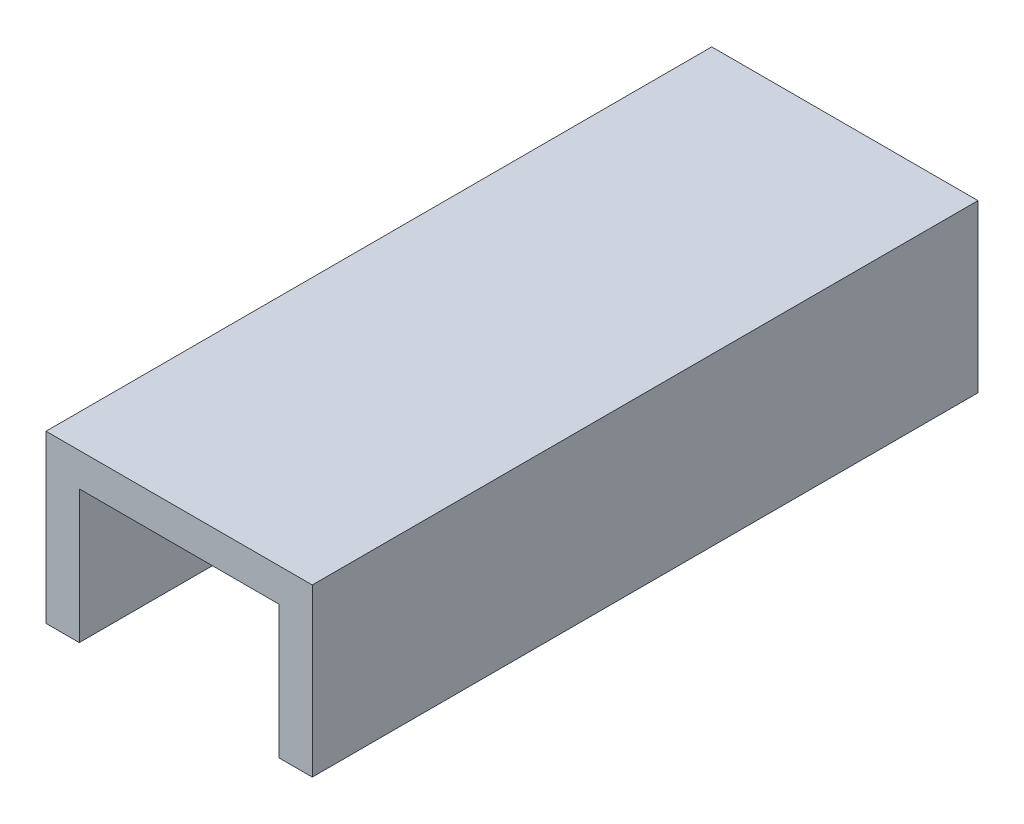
ISO-10303-21;
HEADER;
FILE_DESCRIPTION(('STEP AP214'),'2;1');
FILE_NAME('part.step','',(''),(''),'','','');
FILE_SCHEMA(('AUTOMOTIVE_DESIGN { 1 0 10303 214 1 1 1 1 }'));
ENDSEC;
DATA;
#1=APPLICATION_CONTEXT('core data for automotive mechanical design processes');
#2=APPLICATION_PROTOCOL_DEFINITION('international standard','automotive_design',2000,#1);
#3=PRODUCT_CONTEXT('',#1,'mechanical');
#4=PRODUCT('Part','Part','',(#3));
#5=PRODUCT_RELATED_PRODUCT_CATEGORY('part','',(#4));
#6=PRODUCT_DEFINITION_FORMATION('','',#4);
#7=PRODUCT_DEFINITION_CONTEXT('part definition',#1,'design');
#8=PRODUCT_DEFINITION('design','',#6,#7);
#9=PRODUCT_DEFINITION_SHAPE('','',#8);
#10=(LENGTH_UNIT() NAMED_UNIT(*) SI_UNIT(.MILLI.,.METRE.));
#11=(NAMED_UNIT(*) PLANE_ANGLE_UNIT() SI_UNIT($,.RADIAN.));
#12=(NAMED_UNIT(*) SI_UNIT($,.STERADIAN.) SOLID_ANGLE_UNIT());
#13=UNCERTAINTY_MEASURE_WITH_UNIT(LENGTH_MEASURE(1.E-05),#10,'distance_accuracy_value','');
#14=(GEOMETRIC_REPRESENTATION_CONTEXT(3) GLOBAL_UNCERTAINTY_ASSIGNED_CONTEXT((#13)) GLOBAL_UNIT_ASSIGNED_CONTEXT((#10,
#11,#12)) REPRESENTATION_CONTEXT('',''));
#15=CARTESIAN_POINT('',(0.,0.,0.));
#16=DIRECTION('',(0.,0.,1.));
#17=DIRECTION('',(1.,0.,0.));
#18=AXIS2_PLACEMENT_3D('',#15,#16,#17);
#19=CARTESIAN_POINT('',(-40.,-40.,200.));
#20=DIRECTION('',(1.,0.,0.));
#21=DIRECTION('',(0.,0.,-1.));
#22=AXIS2_PLACEMENT_3D('',#19,#20,#21);
#23=PLANE('',#22);
#24=DIRECTION('',(0.,-1.,0.));
#25=VECTOR('',#24,1.);
#26=CARTESIAN_POINT('',(-40.,-40.,0.));
#27=LINE('',#26,#25);
#28=CARTESIAN_POINT('',(-40.,9.99999999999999,0.));
#29=VERTEX_POINT('',#28);
#30=CARTESIAN_POINT('',(-40.,-40.,0.));
#31=VERTEX_POINT('',#30);
#32=EDGE_CURVE('E101',#29,#31,#27,.T.);
#33=ORIENTED_EDGE('',*,*,#32,.T.);
#34=DIRECTION('',(0.,0.,-1.));
#35=VECTOR('',#34,1.);
#36=CARTESIAN_POINT('',(-40.,-40.,200.));
#37=LINE('',#36,#35);
#38=CARTESIAN_POINT('',(-40.,-40.,200.));
#39=VERTEX_POINT('',#38);
#40=EDGE_CURVE('E11',#39,#31,#37,.T.);
#41=ORIENTED_EDGE('',*,*,#40,.F.);
#42=DIRECTION('',(0.,-1.,0.));
#43=VECTOR('',#42,1.);
#44=CARTESIAN_POINT('',(-40.,-40.,200.));
#45=LINE('',#44,#43);
#46=CARTESIAN_POINT('',(-40.,9.99999999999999,200.));
#47=VERTEX_POINT('',#46);
#48=EDGE_CURVE('E128',#47,#39,#45,.T.);
#49=ORIENTED_EDGE('',*,*,#48,.F.);
#50=DIRECTION('',(0.,0.,-1.));
#51=VECTOR('',#50,1.);
#52=CARTESIAN_POINT('',(-40.,9.99999999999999,200.));
#53=LINE('',#52,#51);
#54=EDGE_CURVE('E114',#47,#29,#53,.T.);
#55=ORIENTED_EDGE('',*,*,#54,.T.);
#56=EDGE_LOOP('',(#33,#41,#49,#55));
#57=FACE_BOUND('',#56,.T.);
#58=ADVANCED_FACE('F33',(#57),#23,.F.);
#59=CARTESIAN_POINT('',(-30.,-40.,200.));
#60=DIRECTION('',(0.,1.,0.));
#61=DIRECTION('',(0.,0.,1.));
#62=AXIS2_PLACEMENT_3D('',#59,#60,#61);
#63=PLANE('',#62);
#64=DIRECTION('',(1.,0.,0.));
#65=VECTOR('',#64,1.);
#66=CARTESIAN_POINT('',(-30.,-40.,0.));
#67=LINE('',#66,#65);
#68=CARTESIAN_POINT('',(-30.,-40.,0.));
#69=VERTEX_POINT('',#68);
#70=EDGE_CURVE('E97',#31,#69,#67,.T.);
#71=ORIENTED_EDGE('',*,*,#70,.T.);
#72=DIRECTION('',(0.,0.,-1.));
#73=VECTOR('',#72,1.);
#74=CARTESIAN_POINT('',(-30.,-40.,200.));
#75=LINE('',#74,#73);
#76=CARTESIAN_POINT('',(-30.,-40.,200.));
#77=VERTEX_POINT('',#76);
#78=EDGE_CURVE('E40',#77,#69,#75,.T.);
#79=ORIENTED_EDGE('',*,*,#78,.F.);
#80=DIRECTION('',(1.,0.,0.));
#81=VECTOR('',#80,1.);
#82=CARTESIAN_POINT('',(-30.,-40.,200.));
#83=LINE('',#82,#81);
#84=EDGE_CURVE('E110',#39,#77,#83,.T.);
#85=ORIENTED_EDGE('',*,*,#84,.F.);
#86=ORIENTED_EDGE('',*,*,#40,.T.);
#87=EDGE_LOOP('',(#71,#79,#85,#86));
#88=FACE_BOUND('',#87,.T.);
#89=ADVANCED_FACE('F109',(#88),#63,.F.);
#90=CARTESIAN_POINT('',(-30.,0.,200.));
#91=DIRECTION('',(-1.,0.,0.));
#92=DIRECTION('',(0.,-1.,0.));
#93=AXIS2_PLACEMENT_3D('',#90,#91,#92);
#94=PLANE('',#93);
#95=DIRECTION('',(0.,1.,0.));
#96=VECTOR('',#95,1.);
#97=CARTESIAN_POINT('',(-30.,0.,0.));
#98=LINE('',#97,#96);
#99=CARTESIAN_POINT('',(-30.,0.,0.));
#100=VERTEX_POINT('',#99);
#101=EDGE_CURVE('E103',#69,#100,#98,.T.);
#102=ORIENTED_EDGE('',*,*,#101,.T.);
#103=DIRECTION('',(0.,0.,-1.));
#104=VECTOR('',#103,1.);
#105=CARTESIAN_POINT('',(-30.,0.,200.));
#106=LINE('',#105,#104);
#107=CARTESIAN_POINT('',(-30.,0.,200.));
#108=VERTEX_POINT('',#107);
#109=EDGE_CURVE('E154',#108,#100,#106,.T.);
#110=ORIENTED_EDGE('',*,*,#109,.F.);
#111=DIRECTION('',(0.,1.,0.));
#112=VECTOR('',#111,1.);
#113=CARTESIAN_POINT('',(-30.,0.,200.));
#114=LINE('',#113,#112);
#115=EDGE_CURVE('E131',#77,#108,#114,.T.);
#116=ORIENTED_EDGE('',*,*,#115,.F.);
#117=ORIENTED_EDGE('',*,*,#78,.T.);
#118=EDGE_LOOP('',(#102,#110,#116,#117));
#119=FACE_BOUND('',#118,.T.);
#120=ADVANCED_FACE('F158',(#119),#94,.F.);
#121=CARTESIAN_POINT('',(30.,0.,200.));
#122=DIRECTION('',(0.,1.,0.));
#123=DIRECTION('',(-1.,0.,0.));
#124=AXIS2_PLACEMENT_3D('',#121,#122,#123);
#125=PLANE('',#124);
#126=DIRECTION('',(1.,0.,0.));
#127=VECTOR('',#126,1.);
#128=CARTESIAN_POINT('',(30.,0.,0.));
#129=LINE('',#128,#127);
#130=CARTESIAN_POINT('',(30.,0.,0.));
#131=VERTEX_POINT('',#130);
#132=EDGE_CURVE('E118',#100,#131,#129,.T.);
#133=ORIENTED_EDGE('',*,*,#132,.T.);
#134=DIRECTION('',(0.,0.,-1.));
#135=VECTOR('',#134,1.);
#136=CARTESIAN_POINT('',(30.,0.,200.));
#137=LINE('',#136,#135);
#138=CARTESIAN_POINT('',(30.,0.,200.));
#139=VERTEX_POINT('',#138);
#140=EDGE_CURVE('E151',#139,#131,#137,.T.);
#141=ORIENTED_EDGE('',*,*,#140,.F.);
#142=DIRECTION('',(1.,0.,0.));
#143=VECTOR('',#142,1.);
#144=CARTESIAN_POINT('',(30.,0.,200.));
#145=LINE('',#144,#143);
#146=EDGE_CURVE('E133',#108,#139,#145,.T.);
#147=ORIENTED_EDGE('',*,*,#146,.F.);
#148=ORIENTED_EDGE('',*,*,#109,.T.);
#149=EDGE_LOOP('',(#133,#141,#147,#148));
#150=FACE_BOUND('',#149,.T.);
#151=ADVANCED_FACE('F166',(#150),#125,.F.);
#152=CARTESIAN_POINT('',(30.,-40.,200.));
#153=DIRECTION('',(1.,0.,0.));
#154=DIRECTION('',(0.,1.,0.));
#155=AXIS2_PLACEMENT_3D('',#152,#153,#154);
#156=PLANE('',#155);
#157=DIRECTION('',(0.,-1.,0.));
#158=VECTOR('',#157,1.);
#159=CARTESIAN_POINT('',(30.,-40.,0.));
#160=LINE('',#159,#158);
#161=CARTESIAN_POINT('',(30.,-40.,0.));
#162=VERTEX_POINT('',#161);
#163=EDGE_CURVE('E120',#131,#162,#160,.T.);
#164=ORIENTED_EDGE('',*,*,#163,.T.);
#165=DIRECTION('',(0.,0.,-1.));
#166=VECTOR('',#165,1.);
#167=CARTESIAN_POINT('',(30.,-40.,200.));
#168=LINE('',#167,#166);
#169=CARTESIAN_POINT('',(30.,-40.,200.));
#170=VERTEX_POINT('',#169);
#171=EDGE_CURVE('E148',#170,#162,#168,.T.);
#172=ORIENTED_EDGE('',*,*,#171,.F.);
#173=DIRECTION('',(0.,-1.,0.));
#174=VECTOR('',#173,1.);
#175=CARTESIAN_POINT('',(30.,-40.,200.));
#176=LINE('',#175,#174);
#177=EDGE_CURVE('E135',#139,#170,#176,.T.);
#178=ORIENTED_EDGE('',*,*,#177,.F.);
#179=ORIENTED_EDGE('',*,*,#140,.T.);
#180=EDGE_LOOP('',(#164,#172,#178,#179));
#181=FACE_BOUND('',#180,.T.);
#182=ADVANCED_FACE('F169',(#181),#156,.F.);
#183=CARTESIAN_POINT('',(40.,-40.,200.));
#184=DIRECTION('',(0.,1.,0.));
#185=DIRECTION('',(0.,0.,1.));
#186=AXIS2_PLACEMENT_3D('',#183,#184,#185);
#187=PLANE('',#186);
#188=DIRECTION('',(1.,0.,0.));
#189=VECTOR('',#188,1.);
#190=CARTESIAN_POINT('',(40.,-40.,0.));
#191=LINE('',#190,#189);
#192=CARTESIAN_POINT('',(40.,-40.,0.));
#193=VERTEX_POINT('',#192);
#194=EDGE_CURVE('E122',#162,#193,#191,.T.);
#195=ORIENTED_EDGE('',*,*,#194,.T.);
#196=DIRECTION('',(0.,0.,-1.));
#197=VECTOR('',#196,1.);
#198=CARTESIAN_POINT('',(40.,-40.,200.));
#199=LINE('',#198,#197);
#200=CARTESIAN_POINT('',(40.,-40.,200.));
#201=VERTEX_POINT('',#200);
#202=EDGE_CURVE('E145',#201,#193,#199,.T.);
#203=ORIENTED_EDGE('',*,*,#202,.F.);
#204=DIRECTION('',(1.,0.,0.));
#205=VECTOR('',#204,1.);
#206=CARTESIAN_POINT('',(40.,-40.,200.));
#207=LINE('',#206,#205);
#208=EDGE_CURVE('E137',#170,#201,#207,.T.);
#209=ORIENTED_EDGE('',*,*,#208,.F.);
#210=ORIENTED_EDGE('',*,*,#171,.T.);
#211=EDGE_LOOP('',(#195,#203,#209,#210));
#212=FACE_BOUND('',#211,.T.);
#213=ADVANCED_FACE('F174',(#212),#187,.F.);
#214=CARTESIAN_POINT('',(40.,10.,200.));
#215=DIRECTION('',(-1.,0.,0.));
#216=DIRECTION('',(0.,0.,1.));
#217=AXIS2_PLACEMENT_3D('',#214,#215,#216);
#218=PLANE('',#217);
#219=DIRECTION('',(0.,1.,0.));
#220=VECTOR('',#219,1.);
#221=CARTESIAN_POINT('',(40.,10.,0.));
#222=LINE('',#221,#220);
#223=CARTESIAN_POINT('',(40.,10.,0.));
#224=VERTEX_POINT('',#223);
#225=EDGE_CURVE('E124',#193,#224,#222,.T.);
#226=ORIENTED_EDGE('',*,*,#225,.T.);
#227=DIRECTION('',(0.,0.,-1.));
#228=VECTOR('',#227,1.);
#229=CARTESIAN_POINT('',(40.,10.,200.));
#230=LINE('',#229,#228);
#231=CARTESIAN_POINT('',(40.,10.,200.));
#232=VERTEX_POINT('',#231);
#233=EDGE_CURVE('E142',#232,#224,#230,.T.);
#234=ORIENTED_EDGE('',*,*,#233,.F.);
#235=DIRECTION('',(0.,1.,0.));
#236=VECTOR('',#235,1.);
#237=CARTESIAN_POINT('',(40.,10.,200.));
#238=LINE('',#237,#236);
#239=EDGE_CURVE('E52',#201,#232,#238,.T.);
#240=ORIENTED_EDGE('',*,*,#239,.F.);
#241=ORIENTED_EDGE('',*,*,#202,.T.);
#242=EDGE_LOOP('',(#226,#234,#240,#241));
#243=FACE_BOUND('',#242,.T.);
#244=ADVANCED_FACE('F177',(#243),#218,.F.);
#245=CARTESIAN_POINT('',(-40.,9.99999999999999,200.));
#246=DIRECTION('',(0.,-1.,0.));
#247=DIRECTION('',(1.,0.,0.));
#248=AXIS2_PLACEMENT_3D('',#245,#246,#247);
#249=PLANE('',#248);
#250=DIRECTION('',(-1.,0.,0.));
#251=VECTOR('',#250,1.);
#252=CARTESIAN_POINT('',(-40.,9.99999999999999,0.));
#253=LINE('',#252,#251);
#254=EDGE_CURVE('E126',#224,#29,#253,.T.);
#255=ORIENTED_EDGE('',*,*,#254,.T.);
#256=ORIENTED_EDGE('',*,*,#54,.F.);
#257=DIRECTION('',(-1.,0.,0.));
#258=VECTOR('',#257,1.);
#259=CARTESIAN_POINT('',(-40.,9.99999999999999,200.));
#260=LINE('',#259,#258);
#261=EDGE_CURVE('E47',#232,#47,#260,.T.);
#262=ORIENTED_EDGE('',*,*,#261,.F.);
#263=ORIENTED_EDGE('',*,*,#233,.T.);
#264=EDGE_LOOP('',(#255,#256,#262,#263));
#265=FACE_BOUND('',#264,.T.);
#266=ADVANCED_FACE('F179',(#265),#249,.F.);
#267=CARTESIAN_POINT('',(-40.,-40.,200.));
#268=DIRECTION('',(0.,0.,1.));
#269=DIRECTION('',(1.,0.,0.));
#270=AXIS2_PLACEMENT_3D('',#267,#268,#269);
#271=PLANE('',#270);
#272=ORIENTED_EDGE('',*,*,#48,.T.);
#273=ORIENTED_EDGE('',*,*,#84,.T.);
#274=ORIENTED_EDGE('',*,*,#115,.T.);
#275=ORIENTED_EDGE('',*,*,#146,.T.);
#276=ORIENTED_EDGE('',*,*,#177,.T.);
#277=ORIENTED_EDGE('',*,*,#208,.T.);
#278=ORIENTED_EDGE('',*,*,#239,.T.);
#279=ORIENTED_EDGE('',*,*,#261,.T.);
#280=EDGE_LOOP('',(#272,#273,#274,#275,#276,#277,#278,#279));
#281=FACE_BOUND('',#280,.T.);
#282=ADVANCED_FACE('F161',(#281),#271,.T.);
#283=CARTESIAN_POINT('',(-40.,-40.,0.));
#284=DIRECTION('',(0.,0.,1.));
#285=DIRECTION('',(1.,0.,0.));
#286=AXIS2_PLACEMENT_3D('',#283,#284,#285);
#287=PLANE('',#286);
#288=ORIENTED_EDGE('',*,*,#32,.F.);
#289=ORIENTED_EDGE('',*,*,#254,.F.);
#290=ORIENTED_EDGE('',*,*,#225,.F.);
#291=ORIENTED_EDGE('',*,*,#194,.F.);
#292=ORIENTED_EDGE('',*,*,#163,.F.);
#293=ORIENTED_EDGE('',*,*,#132,.F.);
#294=ORIENTED_EDGE('',*,*,#101,.F.);
#295=ORIENTED_EDGE('',*,*,#70,.F.);
#296=EDGE_LOOP('',(#288,#289,#290,#291,#292,#293,#294,#295));
#297=FACE_BOUND('',#296,.T.);
#298=ADVANCED_FACE('F98',(#297),#287,.F.);
#299=CLOSED_SHELL('',(#58,#89,#120,#151,#182,#213,#244,#266,#282,#298));
#300=MANIFOLD_SOLID_BREP('B2',#299);
#301=ADVANCED_BREP_SHAPE_REPRESENTATION('',(#18,#300),#14);
#302=SHAPE_DEFINITION_REPRESENTATION(#9,#301);
ENDSEC;
END-ISO-10303-21;
